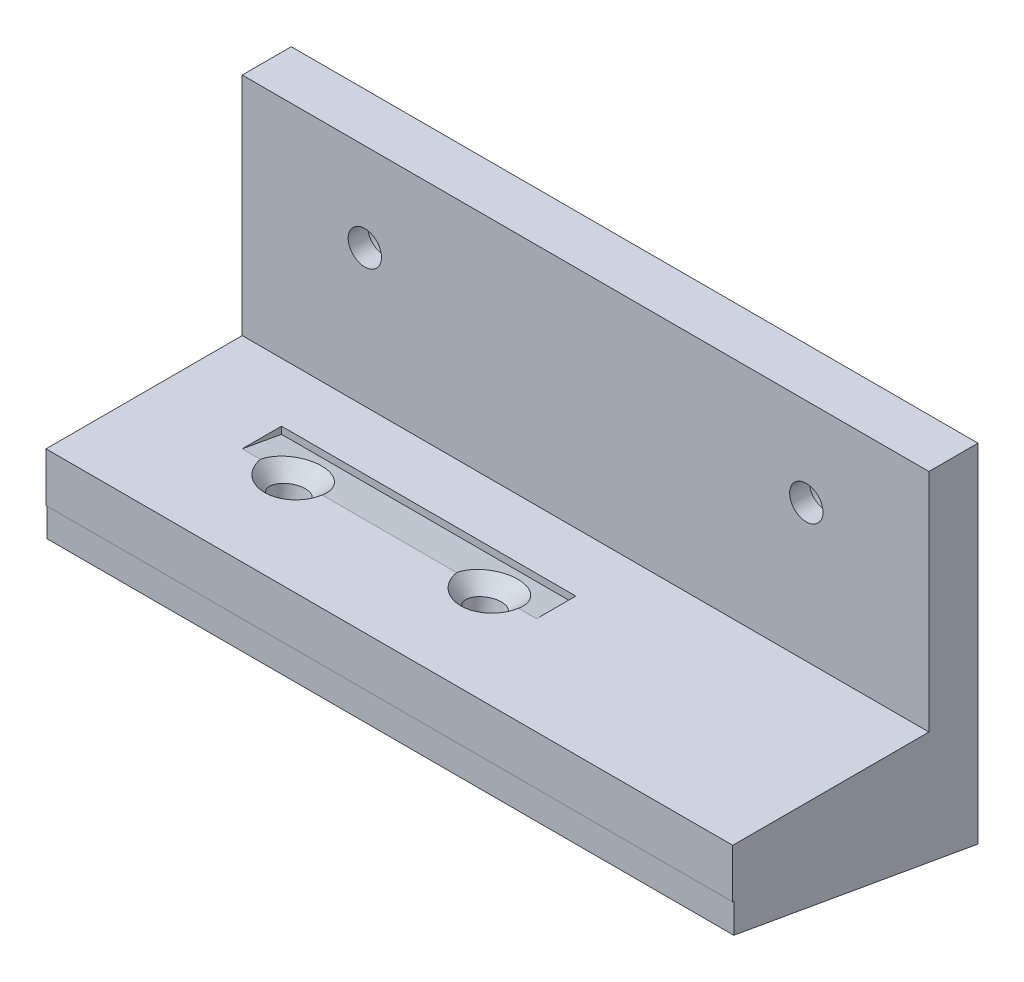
from build123d import *

# Parameters (mm, degrees)
SKETCH1_W                                      = 70
SKETCH1_H                                      = 28
MAINEXTRUDE_DEPTH                              = 25
SKETCH3_W                                      = 20
SKETCH3_H                                      = 23
L_BRACKET_CUT_DEPTH                            = 76.637292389
CBORE_FOR_M3_SHCS1_D                           = 3.4
CBORE_FOR_M3_SHCS1_CBORE_D                     = 6.5
CBORE_FOR_M3_SHCS1_CBORE_DEPTH                 = 3
BOSS_EXTRUDE1_DEPTH                            = 70
CSK_FOR_M3_FLAT_HEAD_MACHINE_SCREW1_AT_2_COUNT = 2
CSK_FOR_M3_FLAT_HEAD_MACHINE_SCREW1_AT_2_PITCH = 20
CUT_EXTRUDE10_START                            = -10
CUT_EXTRUDE10_DEPTH                            = 30


with BuildPart() as part:
    # Sketch1 → MainExtrude (new body)
    with BuildSketch(Plane.XY):
        Rectangle(SKETCH1_W, SKETCH1_H)
    extrude(amount=MAINEXTRUDE_DEPTH)

    # Sketch3 → L Bracket cut (cut, through all)
    with BuildSketch(Plane(origin=(35, 0, 0), x_dir=(0, 0, -1), z_dir=(1, 0, 0))):
        with Locations((-15, 2.5)):
            Rectangle(SKETCH3_W, SKETCH3_H)
    extrude(amount=-L_BRACKET_CUT_DEPTH, mode=Mode.SUBTRACT)

    # CBORE for M3 SHCS1 (through all)
    with Locations(Plane(origin=(22.5, 5, 0), x_dir=(-1, 0, 0), z_dir=(0, 0, -1))):
        with Locations((0, 0), (45, 0)):
            CounterBoreHole(CBORE_FOR_M3_SHCS1_D / 2, CBORE_FOR_M3_SHCS1_CBORE_D / 2, CBORE_FOR_M3_SHCS1_CBORE_DEPTH)

    # Sketch20 → Boss-Extrude1 (add)
    with BuildSketch(Plane.ZY.offset(35)):
        Polygon((24.887649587, -14), (0, -14), (0, -21.388364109), (24.887649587, -17), align=None)
    extrude(amount=-BOSS_EXTRUDE1_DEPTH)

    # Sketch22 → CSK for M3 Flat Head Machine Screw1 (revolve, cut)
    with BuildSketch(Plane(origin=(-20, -9, 15), x_dir=(0, 0.1736481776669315, 0.984807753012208), z_dir=(1, 0, 0))):
        Polygon((0, 0), (0, 13.936638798), (1.7, 13.936638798), (1.7, 1.45), (3.15, 0), align=None)
    csk_for_m3_flat_head_machine_screw1 = revolve(axis=Axis((-20, -2.746470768, 13.897334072), (0, -0.984807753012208, 0.17364817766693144)), mode=Mode.SUBTRACT)

    # CSK for M3 Flat Head Machine Screw1 at 2: CSK for M3 Flat Head Machine Screw1 ×2
    with Locations(*[(i * CSK_FOR_M3_FLAT_HEAD_MACHINE_SCREW1_AT_2_PITCH, 0, 0) for i in range(1, CSK_FOR_M3_FLAT_HEAD_MACHINE_SCREW1_AT_2_COUNT)]):
        add(csk_for_m3_flat_head_machine_screw1, mode=Mode.SUBTRACT)

    # Sketch24 → Cut-Extrude10 (cut)
    with BuildSketch(Plane.ZY.offset(35).offset(CUT_EXTRUDE10_START)):
        Polygon((15, -9), (10.996344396, -9.720371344), (10.996344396, -9), align=None)
    extrude(amount=-CUT_EXTRUDE10_DEPTH, mode=Mode.SUBTRACT)


solid = part.part
